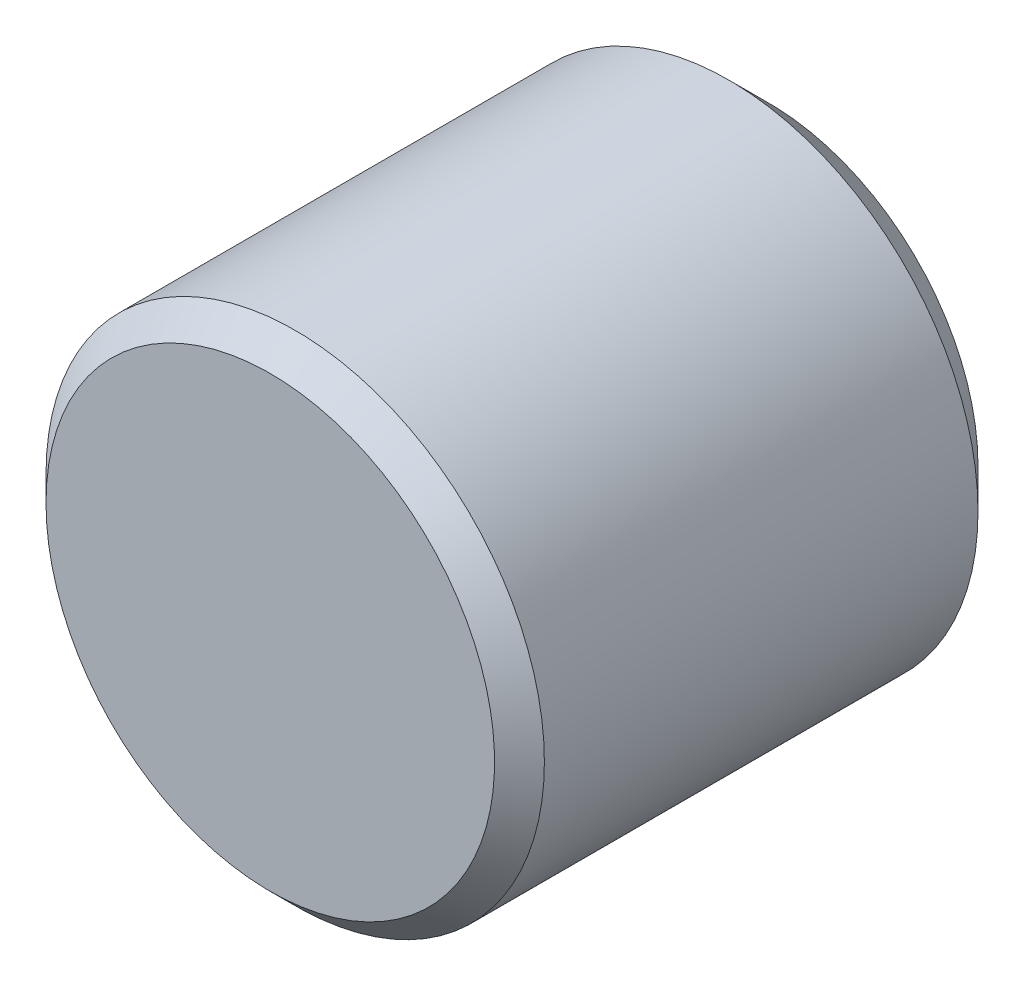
ISO-10303-21;
HEADER;
FILE_DESCRIPTION(('STEP AP214'),'2;1');
FILE_NAME('part.step','',(''),(''),'','','');
FILE_SCHEMA(('AUTOMOTIVE_DESIGN { 1 0 10303 214 1 1 1 1 }'));
ENDSEC;
DATA;
#1=APPLICATION_CONTEXT('core data for automotive mechanical design processes');
#2=APPLICATION_PROTOCOL_DEFINITION('international standard','automotive_design',2000,#1);
#3=PRODUCT_CONTEXT('',#1,'mechanical');
#4=PRODUCT('Part','Part','',(#3));
#5=PRODUCT_RELATED_PRODUCT_CATEGORY('part','',(#4));
#6=PRODUCT_DEFINITION_FORMATION('','',#4);
#7=PRODUCT_DEFINITION_CONTEXT('part definition',#1,'design');
#8=PRODUCT_DEFINITION('design','',#6,#7);
#9=PRODUCT_DEFINITION_SHAPE('','',#8);
#10=(LENGTH_UNIT() NAMED_UNIT(*) SI_UNIT(.MILLI.,.METRE.));
#11=(NAMED_UNIT(*) PLANE_ANGLE_UNIT() SI_UNIT($,.RADIAN.));
#12=(NAMED_UNIT(*) SI_UNIT($,.STERADIAN.) SOLID_ANGLE_UNIT());
#13=UNCERTAINTY_MEASURE_WITH_UNIT(LENGTH_MEASURE(1.E-05),#10,'distance_accuracy_value','');
#14=(GEOMETRIC_REPRESENTATION_CONTEXT(3) GLOBAL_UNCERTAINTY_ASSIGNED_CONTEXT((#13)) GLOBAL_UNIT_ASSIGNED_CONTEXT((#10,
#11,#12)) REPRESENTATION_CONTEXT('',''));
#15=CARTESIAN_POINT('',(0.,0.,0.));
#16=DIRECTION('',(0.,0.,1.));
#17=DIRECTION('',(1.,0.,0.));
#18=AXIS2_PLACEMENT_3D('',#15,#16,#17);
#19=CARTESIAN_POINT('',(0.,0.,30.));
#20=DIRECTION('',(0.,0.,1.));
#21=DIRECTION('',(1.,0.,0.));
#22=AXIS2_PLACEMENT_3D('',#19,#20,#21);
#23=CYLINDRICAL_SURFACE('',#22,5.);
#24=CARTESIAN_POINT('',(0.,0.,0.8));
#25=DIRECTION('',(0.,0.,1.));
#26=DIRECTION('',(1.,0.,0.));
#27=AXIS2_PLACEMENT_3D('',#24,#25,#26);
#28=CIRCLE('',#27,5.);
#29=CARTESIAN_POINT('',(5.,0.,0.8));
#30=VERTEX_POINT('',#29);
#31=EDGE_CURVE('E19',#30,#30,#28,.T.);
#32=ORIENTED_EDGE('',*,*,#31,.T.);
#33=EDGE_LOOP('',(#32));
#34=FACE_BOUND('',#33,.T.);
#35=CARTESIAN_POINT('',(0.,0.,9.5));
#36=DIRECTION('',(0.,0.,-1.));
#37=DIRECTION('',(-1.,0.,0.));
#38=AXIS2_PLACEMENT_3D('',#35,#36,#37);
#39=CIRCLE('',#38,5.);
#40=CARTESIAN_POINT('',(-5.,0.,9.5));
#41=VERTEX_POINT('',#40);
#42=EDGE_CURVE('E23',#41,#41,#39,.T.);
#43=ORIENTED_EDGE('',*,*,#42,.T.);
#44=EDGE_LOOP('',(#43));
#45=FACE_BOUND('',#44,.T.);
#46=ADVANCED_FACE('F12',(#34,#45),#23,.T.);
#47=CARTESIAN_POINT('',(2.5,0.,0.));
#48=DIRECTION('',(0.,0.,1.));
#49=DIRECTION('',(1.,0.,0.));
#50=AXIS2_PLACEMENT_3D('',#47,#48,#49);
#51=PLANE('',#50);
#52=CARTESIAN_POINT('',(0.,0.,0.));
#53=DIRECTION('',(0.,0.,1.));
#54=DIRECTION('',(1.,0.,0.));
#55=AXIS2_PLACEMENT_3D('',#52,#53,#54);
#56=CIRCLE('',#55,4.2);
#57=CARTESIAN_POINT('',(4.2,0.,0.));
#58=VERTEX_POINT('',#57);
#59=EDGE_CURVE('E8',#58,#58,#56,.F.);
#60=ORIENTED_EDGE('',*,*,#59,.T.);
#61=EDGE_LOOP('',(#60));
#62=FACE_BOUND('',#61,.T.);
#63=CARTESIAN_POINT('',(0.,0.,0.));
#64=DIRECTION('',(0.,0.,1.));
#65=DIRECTION('',(1.,0.,0.));
#66=AXIS2_PLACEMENT_3D('',#63,#64,#65);
#67=CIRCLE('',#66,2.5);
#68=CARTESIAN_POINT('',(2.5,0.,0.));
#69=VERTEX_POINT('',#68);
#70=EDGE_CURVE('E32',#69,#69,#67,.T.);
#71=ORIENTED_EDGE('',*,*,#70,.T.);
#72=EDGE_LOOP('',(#71));
#73=FACE_BOUND('',#72,.T.);
#74=ADVANCED_FACE('F54',(#62,#73),#51,.F.);
#75=CARTESIAN_POINT('',(0.,0.,30.));
#76=DIRECTION('',(0.,0.,1.));
#77=DIRECTION('',(1.,0.,0.));
#78=AXIS2_PLACEMENT_3D('',#75,#76,#77);
#79=CYLINDRICAL_SURFACE('',#78,2.5);
#80=ORIENTED_EDGE('',*,*,#70,.F.);
#81=EDGE_LOOP('',(#80));
#82=FACE_BOUND('',#81,.T.);
#83=CARTESIAN_POINT('',(0.,0.,5.));
#84=DIRECTION('',(0.,0.,1.));
#85=DIRECTION('',(1.,0.,0.));
#86=AXIS2_PLACEMENT_3D('',#83,#84,#85);
#87=CIRCLE('',#86,2.5);
#88=CARTESIAN_POINT('',(2.5,0.,5.));
#89=VERTEX_POINT('',#88);
#90=EDGE_CURVE('E35',#89,#89,#87,.T.);
#91=ORIENTED_EDGE('',*,*,#90,.T.);
#92=EDGE_LOOP('',(#91));
#93=FACE_BOUND('',#92,.T.);
#94=ADVANCED_FACE('F39',(#82,#93),#79,.F.);
#95=CARTESIAN_POINT('',(0.,0.,5.));
#96=DIRECTION('',(0.,0.,1.));
#97=DIRECTION('',(1.,0.,0.));
#98=AXIS2_PLACEMENT_3D('',#95,#96,#97);
#99=PLANE('',#98);
#100=ORIENTED_EDGE('',*,*,#90,.F.);
#101=EDGE_LOOP('',(#100));
#102=FACE_BOUND('',#101,.T.);
#103=ADVANCED_FACE('F41',(#102),#99,.F.);
#104=CARTESIAN_POINT('',(5.,0.,10.));
#105=DIRECTION('',(0.,0.,-1.));
#106=DIRECTION('',(-1.,0.,0.));
#107=AXIS2_PLACEMENT_3D('',#104,#105,#106);
#108=PLANE('',#107);
#109=CARTESIAN_POINT('',(0.,0.,10.));
#110=DIRECTION('',(0.,0.,-1.));
#111=DIRECTION('',(-1.,0.,0.));
#112=AXIS2_PLACEMENT_3D('',#109,#110,#111);
#113=CIRCLE('',#112,4.5);
#114=CARTESIAN_POINT('',(-4.5,0.,10.));
#115=VERTEX_POINT('',#114);
#116=EDGE_CURVE('E27',#115,#115,#113,.F.);
#117=ORIENTED_EDGE('',*,*,#116,.T.);
#118=EDGE_LOOP('',(#117));
#119=FACE_BOUND('',#118,.T.);
#120=ADVANCED_FACE('F43',(#119),#108,.F.);
#121=CARTESIAN_POINT('',(0.,0.,10.));
#122=DIRECTION('',(0.,0.,-1.));
#123=DIRECTION('',(-1.,0.,0.));
#124=AXIS2_PLACEMENT_3D('',#121,#122,#123);
#125=CONICAL_SURFACE('',#124,4.5,0.785398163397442);
#126=ORIENTED_EDGE('',*,*,#42,.F.);
#127=EDGE_LOOP('',(#126));
#128=FACE_BOUND('',#127,.T.);
#129=ORIENTED_EDGE('',*,*,#116,.F.);
#130=EDGE_LOOP('',(#129));
#131=FACE_BOUND('',#130,.T.);
#132=ADVANCED_FACE('F51',(#128,#131),#125,.T.);
#133=CARTESIAN_POINT('',(0.,0.,0.8));
#134=DIRECTION('',(0.,0.,1.));
#135=DIRECTION('',(1.,0.,0.));
#136=AXIS2_PLACEMENT_3D('',#133,#134,#135);
#137=CONICAL_SURFACE('',#136,5.,0.78539816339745);
#138=ORIENTED_EDGE('',*,*,#59,.F.);
#139=EDGE_LOOP('',(#138));
#140=FACE_BOUND('',#139,.T.);
#141=ORIENTED_EDGE('',*,*,#31,.F.);
#142=EDGE_LOOP('',(#141));
#143=FACE_BOUND('',#142,.T.);
#144=ADVANCED_FACE('F14',(#140,#143),#137,.T.);
#145=CLOSED_SHELL('',(#46,#74,#94,#103,#120,#132,#144));
#146=MANIFOLD_SOLID_BREP('B1',#145);
#147=ADVANCED_BREP_SHAPE_REPRESENTATION('',(#18,#146),#14);
#148=SHAPE_DEFINITION_REPRESENTATION(#9,#147);
ENDSEC;
END-ISO-10303-21;
